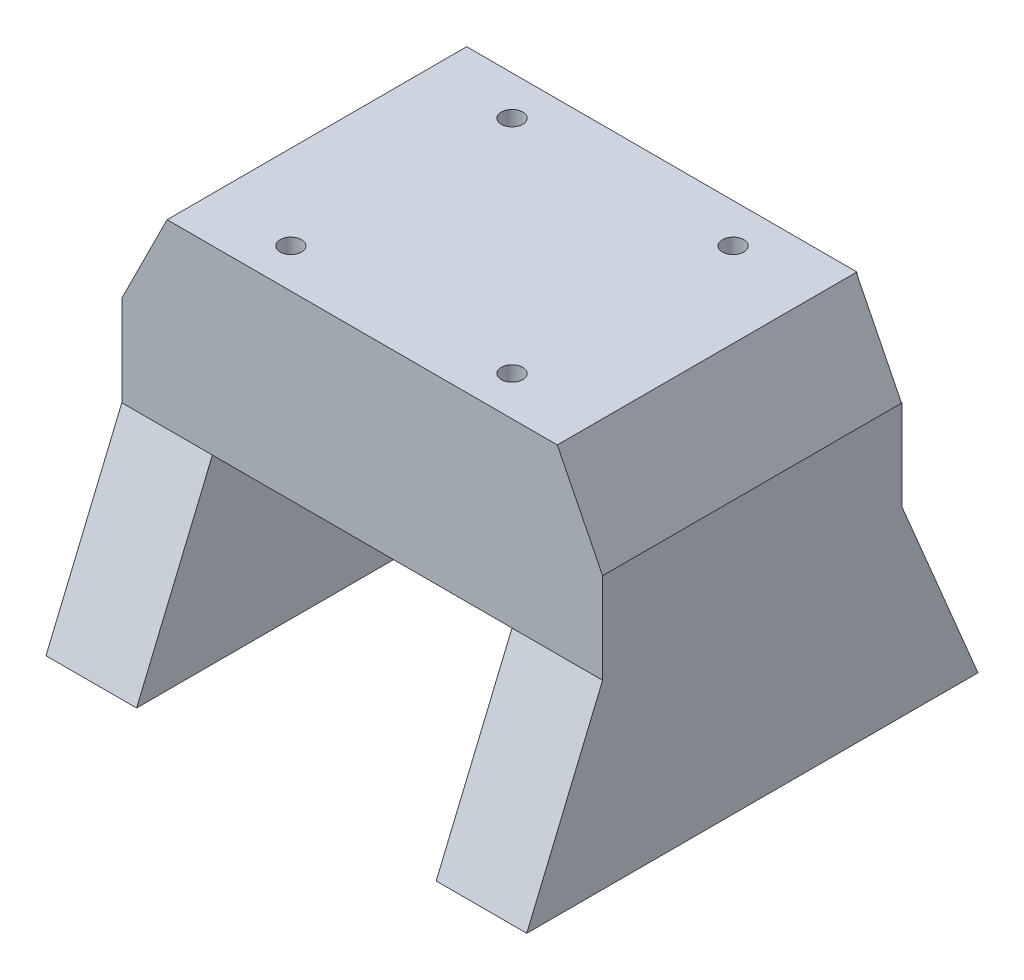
ISO-10303-21;
HEADER;
FILE_DESCRIPTION(('STEP AP214'),'2;1');
FILE_NAME('part.step','',(''),(''),'','','');
FILE_SCHEMA(('AUTOMOTIVE_DESIGN { 1 0 10303 214 1 1 1 1 }'));
ENDSEC;
DATA;
#1=APPLICATION_CONTEXT('core data for automotive mechanical design processes');
#2=APPLICATION_PROTOCOL_DEFINITION('international standard','automotive_design',2000,#1);
#3=PRODUCT_CONTEXT('',#1,'mechanical');
#4=PRODUCT('Part','Part','',(#3));
#5=PRODUCT_RELATED_PRODUCT_CATEGORY('part','',(#4));
#6=PRODUCT_DEFINITION_FORMATION('','',#4);
#7=PRODUCT_DEFINITION_CONTEXT('part definition',#1,'design');
#8=PRODUCT_DEFINITION('design','',#6,#7);
#9=PRODUCT_DEFINITION_SHAPE('','',#8);
#10=(LENGTH_UNIT() NAMED_UNIT(*) SI_UNIT(.MILLI.,.METRE.));
#11=(NAMED_UNIT(*) PLANE_ANGLE_UNIT() SI_UNIT($,.RADIAN.));
#12=(NAMED_UNIT(*) SI_UNIT($,.STERADIAN.) SOLID_ANGLE_UNIT());
#13=UNCERTAINTY_MEASURE_WITH_UNIT(LENGTH_MEASURE(1.E-05),#10,'distance_accuracy_value','');
#14=(GEOMETRIC_REPRESENTATION_CONTEXT(3) GLOBAL_UNCERTAINTY_ASSIGNED_CONTEXT((#13)) GLOBAL_UNIT_ASSIGNED_CONTEXT((#10,
#11,#12)) REPRESENTATION_CONTEXT('',''));
#15=CARTESIAN_POINT('',(0.,0.,0.));
#16=DIRECTION('',(0.,0.,1.));
#17=DIRECTION('',(1.,0.,0.));
#18=AXIS2_PLACEMENT_3D('',#15,#16,#17);
#19=CARTESIAN_POINT('',(27.350000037,25.4,-21.));
#20=DIRECTION('',(-1.,0.,0.));
#21=DIRECTION('',(0.,0.,1.));
#22=AXIS2_PLACEMENT_3D('',#19,#20,#21);
#23=PLANE('',#22);
#24=DIRECTION('',(0.,1.,0.));
#25=VECTOR('',#24,1.);
#26=CARTESIAN_POINT('',(27.350000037,0.,-20.91));
#27=LINE('',#26,#25);
#28=CARTESIAN_POINT('',(27.350000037,12.7,-20.91));
#29=VERTEX_POINT('',#28);
#30=CARTESIAN_POINT('',(27.350000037,25.4,-20.91));
#31=VERTEX_POINT('',#30);
#32=EDGE_CURVE('E67',#29,#31,#27,.T.);
#33=ORIENTED_EDGE('',*,*,#32,.F.);
#34=DIRECTION('',(0.,0.,-1.));
#35=VECTOR('',#34,1.);
#36=CARTESIAN_POINT('',(27.350000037,12.7,-21.));
#37=LINE('',#36,#35);
#38=CARTESIAN_POINT('',(27.350000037,12.7,-21.));
#39=VERTEX_POINT('',#38);
#40=EDGE_CURVE('E242',#29,#39,#37,.T.);
#41=ORIENTED_EDGE('',*,*,#40,.T.);
#42=DIRECTION('',(0.,-1.,0.));
#43=VECTOR('',#42,1.);
#44=CARTESIAN_POINT('',(27.350000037,25.4,-21.));
#45=LINE('',#44,#43);
#46=CARTESIAN_POINT('',(27.350000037,25.4,-21.));
#47=VERTEX_POINT('',#46);
#48=EDGE_CURVE('E11',#47,#39,#45,.T.);
#49=ORIENTED_EDGE('',*,*,#48,.F.);
#50=DIRECTION('',(0.,0.,-1.));
#51=VECTOR('',#50,1.);
#52=CARTESIAN_POINT('',(27.350000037,25.4,-21.));
#53=LINE('',#52,#51);
#54=EDGE_CURVE('E62',#31,#47,#53,.T.);
#55=ORIENTED_EDGE('',*,*,#54,.F.);
#56=EDGE_LOOP('',(#33,#41,#49,#55));
#57=FACE_BOUND('',#56,.T.);
#58=ADVANCED_FACE('F47',(#57),#23,.F.);
#59=CARTESIAN_POINT('',(-27.350000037,25.4,-21.));
#60=DIRECTION('',(1.,0.,0.));
#61=DIRECTION('',(0.,0.,-1.));
#62=AXIS2_PLACEMENT_3D('',#59,#60,#61);
#63=PLANE('',#62);
#64=DIRECTION('',(0.,-1.,0.));
#65=VECTOR('',#64,1.);
#66=CARTESIAN_POINT('',(-27.350000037,0.,-20.91));
#67=LINE('',#66,#65);
#68=CARTESIAN_POINT('',(-27.350000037,25.4,-20.91));
#69=VERTEX_POINT('',#68);
#70=CARTESIAN_POINT('',(-27.350000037,12.7,-20.91));
#71=VERTEX_POINT('',#70);
#72=EDGE_CURVE('E159',#69,#71,#67,.T.);
#73=ORIENTED_EDGE('',*,*,#72,.F.);
#74=DIRECTION('',(0.,0.,1.));
#75=VECTOR('',#74,1.);
#76=CARTESIAN_POINT('',(-27.350000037,25.4,-21.));
#77=LINE('',#76,#75);
#78=CARTESIAN_POINT('',(-27.350000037,25.4,-21.));
#79=VERTEX_POINT('',#78);
#80=EDGE_CURVE('E284',#79,#69,#77,.T.);
#81=ORIENTED_EDGE('',*,*,#80,.F.);
#82=DIRECTION('',(0.,-1.,0.));
#83=VECTOR('',#82,1.);
#84=CARTESIAN_POINT('',(-27.350000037,25.4,-21.));
#85=LINE('',#84,#83);
#86=CARTESIAN_POINT('',(-27.350000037,12.7,-21.));
#87=VERTEX_POINT('',#86);
#88=EDGE_CURVE('E55',#79,#87,#85,.T.);
#89=ORIENTED_EDGE('',*,*,#88,.T.);
#90=DIRECTION('',(0.,0.,1.));
#91=VECTOR('',#90,1.);
#92=CARTESIAN_POINT('',(-27.350000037,12.7,-21.));
#93=LINE('',#92,#91);
#94=EDGE_CURVE('E176',#87,#71,#93,.T.);
#95=ORIENTED_EDGE('',*,*,#94,.T.);
#96=EDGE_LOOP('',(#73,#81,#89,#95));
#97=FACE_BOUND('',#96,.T.);
#98=ADVANCED_FACE('F183',(#97),#63,.F.);
#99=CARTESIAN_POINT('',(33.700000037,12.7,0.));
#100=DIRECTION('',(0.,1.,0.));
#101=DIRECTION('',(0.,0.,1.));
#102=AXIS2_PLACEMENT_3D('',#99,#100,#101);
#103=PLANE('',#102);
#104=ORIENTED_EDGE('',*,*,#40,.F.);
#105=DIRECTION('',(-1.,0.,0.));
#106=VECTOR('',#105,1.);
#107=CARTESIAN_POINT('',(0.,12.7,-20.91));
#108=LINE('',#107,#106);
#109=CARTESIAN_POINT('',(33.700000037,12.7,-20.91));
#110=VERTEX_POINT('',#109);
#111=EDGE_CURVE('E311',#110,#29,#108,.T.);
#112=ORIENTED_EDGE('',*,*,#111,.F.);
#113=DIRECTION('',(0.,0.,-1.));
#114=VECTOR('',#113,1.);
#115=CARTESIAN_POINT('',(33.700000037,12.7,0.));
#116=LINE('',#115,#114);
#117=CARTESIAN_POINT('',(33.700000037,12.7,-21.));
#118=VERTEX_POINT('',#117);
#119=EDGE_CURVE('E203',#110,#118,#116,.T.);
#120=ORIENTED_EDGE('',*,*,#119,.T.);
#121=DIRECTION('',(-1.,0.,0.));
#122=VECTOR('',#121,1.);
#123=CARTESIAN_POINT('',(33.700000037,12.7,-21.));
#124=LINE('',#123,#122);
#125=EDGE_CURVE('E220',#118,#39,#124,.T.);
#126=ORIENTED_EDGE('',*,*,#125,.T.);
#127=EDGE_LOOP('',(#104,#112,#120,#126));
#128=FACE_BOUND('',#127,.T.);
#129=ADVANCED_FACE('F308',(#128),#103,.T.);
#130=CARTESIAN_POINT('',(-21.000000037,12.7,0.));
#131=DIRECTION('',(0.,1.,0.));
#132=DIRECTION('',(0.,0.,1.));
#133=AXIS2_PLACEMENT_3D('',#130,#131,#132);
#134=PLANE('',#133);
#135=DIRECTION('',(0.,0.,-1.));
#136=VECTOR('',#135,1.);
#137=CARTESIAN_POINT('',(-33.700000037,12.7,0.));
#138=LINE('',#137,#136);
#139=CARTESIAN_POINT('',(-33.700000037,12.7,-20.91));
#140=VERTEX_POINT('',#139);
#141=CARTESIAN_POINT('',(-33.700000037,12.7,-21.));
#142=VERTEX_POINT('',#141);
#143=EDGE_CURVE('E178',#140,#142,#138,.T.);
#144=ORIENTED_EDGE('',*,*,#143,.F.);
#145=DIRECTION('',(-1.,0.,0.));
#146=VECTOR('',#145,1.);
#147=CARTESIAN_POINT('',(0.,12.7,-20.91));
#148=LINE('',#147,#146);
#149=EDGE_CURVE('E162',#71,#140,#148,.T.);
#150=ORIENTED_EDGE('',*,*,#149,.F.);
#151=ORIENTED_EDGE('',*,*,#94,.F.);
#152=DIRECTION('',(-1.,0.,0.));
#153=VECTOR('',#152,1.);
#154=CARTESIAN_POINT('',(-21.000000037,12.7,-21.));
#155=LINE('',#154,#153);
#156=EDGE_CURVE('E376',#87,#142,#155,.T.);
#157=ORIENTED_EDGE('',*,*,#156,.T.);
#158=EDGE_LOOP('',(#144,#150,#151,#157));
#159=FACE_BOUND('',#158,.T.);
#160=ADVANCED_FACE('F174',(#159),#134,.T.);
#161=CARTESIAN_POINT('',(0.,0.,0.));
#162=DIRECTION('',(0.,1.,0.));
#163=DIRECTION('',(0.,0.,1.));
#164=AXIS2_PLACEMENT_3D('',#161,#162,#163);
#165=PLANE('',#164);
#166=CARTESIAN_POINT('',(-15.5,0.,15.5));
#167=DIRECTION('',(0.,1.,0.));
#168=DIRECTION('',(0.,0.,1.));
#169=AXIS2_PLACEMENT_3D('',#166,#167,#168);
#170=CIRCLE('',#169,1.5);
#171=CARTESIAN_POINT('',(-15.5,0.,17.));
#172=VERTEX_POINT('',#171);
#173=EDGE_CURVE('E245',#172,#172,#170,.T.);
#174=ORIENTED_EDGE('',*,*,#173,.T.);
#175=EDGE_LOOP('',(#174));
#176=FACE_BOUND('',#175,.T.);
#177=CARTESIAN_POINT('',(15.5,0.,15.5));
#178=DIRECTION('',(0.,1.,0.));
#179=DIRECTION('',(0.,0.,1.));
#180=AXIS2_PLACEMENT_3D('',#177,#178,#179);
#181=CIRCLE('',#180,1.5);
#182=CARTESIAN_POINT('',(15.5,0.,17.));
#183=VERTEX_POINT('',#182);
#184=EDGE_CURVE('E250',#183,#183,#181,.T.);
#185=ORIENTED_EDGE('',*,*,#184,.T.);
#186=EDGE_LOOP('',(#185));
#187=FACE_BOUND('',#186,.T.);
#188=CARTESIAN_POINT('',(15.5,0.,-15.5));
#189=DIRECTION('',(0.,1.,0.));
#190=DIRECTION('',(0.,0.,1.));
#191=AXIS2_PLACEMENT_3D('',#188,#189,#190);
#192=CIRCLE('',#191,1.5);
#193=CARTESIAN_POINT('',(15.5,0.,-14.));
#194=VERTEX_POINT('',#193);
#195=EDGE_CURVE('E258',#194,#194,#192,.T.);
#196=ORIENTED_EDGE('',*,*,#195,.T.);
#197=EDGE_LOOP('',(#196));
#198=FACE_BOUND('',#197,.T.);
#199=CARTESIAN_POINT('',(-15.5,0.,-15.5));
#200=DIRECTION('',(0.,1.,0.));
#201=DIRECTION('',(0.,0.,1.));
#202=AXIS2_PLACEMENT_3D('',#199,#200,#201);
#203=CIRCLE('',#202,1.5);
#204=CARTESIAN_POINT('',(-15.5,0.,-14.));
#205=VERTEX_POINT('',#204);
#206=EDGE_CURVE('E266',#205,#205,#203,.T.);
#207=ORIENTED_EDGE('',*,*,#206,.T.);
#208=EDGE_LOOP('',(#207));
#209=FACE_BOUND('',#208,.T.);
#210=DIRECTION('',(1.,0.,0.));
#211=VECTOR('',#210,1.);
#212=CARTESIAN_POINT('',(-27.350000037,0.,21.));
#213=LINE('',#212,#211);
#214=CARTESIAN_POINT('',(-21.000000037,0.,21.));
#215=VERTEX_POINT('',#214);
#216=CARTESIAN_POINT('',(21.000000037,0.,21.));
#217=VERTEX_POINT('',#216);
#218=EDGE_CURVE('E298',#215,#217,#213,.T.);
#219=ORIENTED_EDGE('',*,*,#218,.F.);
#220=DIRECTION('',(0.,0.,-1.));
#221=VECTOR('',#220,1.);
#222=CARTESIAN_POINT('',(-21.000000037,0.,0.));
#223=LINE('',#222,#221);
#224=CARTESIAN_POINT('',(-21.000000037,0.,-21.));
#225=VERTEX_POINT('',#224);
#226=EDGE_CURVE('E187',#215,#225,#223,.T.);
#227=ORIENTED_EDGE('',*,*,#226,.T.);
#228=DIRECTION('',(-1.,0.,0.));
#229=VECTOR('',#228,1.);
#230=CARTESIAN_POINT('',(-27.350000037,0.,-21.));
#231=LINE('',#230,#229);
#232=CARTESIAN_POINT('',(21.000000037,0.,-21.));
#233=VERTEX_POINT('',#232);
#234=EDGE_CURVE('E274',#233,#225,#231,.T.);
#235=ORIENTED_EDGE('',*,*,#234,.F.);
#236=DIRECTION('',(0.,0.,-1.));
#237=VECTOR('',#236,1.);
#238=CARTESIAN_POINT('',(21.000000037,0.,0.));
#239=LINE('',#238,#237);
#240=EDGE_CURVE('E239',#217,#233,#239,.T.);
#241=ORIENTED_EDGE('',*,*,#240,.F.);
#242=EDGE_LOOP('',(#219,#227,#235,#241));
#243=FACE_BOUND('',#242,.T.);
#244=ADVANCED_FACE('F402',(#176,#187,#198,#209,#243),#165,.F.);
#245=CARTESIAN_POINT('',(0.,25.4,0.));
#246=DIRECTION('',(0.,1.,0.));
#247=DIRECTION('',(0.,0.,1.));
#248=AXIS2_PLACEMENT_3D('',#245,#246,#247);
#249=PLANE('',#248);
#250=CARTESIAN_POINT('',(15.5,25.4,15.5));
#251=DIRECTION('',(0.,1.,0.));
#252=DIRECTION('',(0.,0.,1.));
#253=AXIS2_PLACEMENT_3D('',#250,#251,#252);
#254=CIRCLE('',#253,1.5);
#255=CARTESIAN_POINT('',(15.5,25.4,17.));
#256=VERTEX_POINT('',#255);
#257=EDGE_CURVE('E254',#256,#256,#254,.T.);
#258=ORIENTED_EDGE('',*,*,#257,.F.);
#259=EDGE_LOOP('',(#258));
#260=FACE_BOUND('',#259,.T.);
#261=CARTESIAN_POINT('',(-15.5,25.4,-15.5));
#262=DIRECTION('',(0.,1.,0.));
#263=DIRECTION('',(0.,0.,1.));
#264=AXIS2_PLACEMENT_3D('',#261,#262,#263);
#265=CIRCLE('',#264,1.5);
#266=CARTESIAN_POINT('',(-15.5,25.4,-14.));
#267=VERTEX_POINT('',#266);
#268=EDGE_CURVE('E270',#267,#267,#265,.T.);
#269=ORIENTED_EDGE('',*,*,#268,.F.);
#270=EDGE_LOOP('',(#269));
#271=FACE_BOUND('',#270,.T.);
#272=CARTESIAN_POINT('',(27.350000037,25.4,21.));
#273=VERTEX_POINT('',#272);
#274=EDGE_CURVE('E278',#273,#31,#53,.T.);
#275=ORIENTED_EDGE('',*,*,#274,.T.);
#276=ORIENTED_EDGE('',*,*,#54,.T.);
#277=DIRECTION('',(-1.,0.,0.));
#278=VECTOR('',#277,1.);
#279=CARTESIAN_POINT('',(-27.350000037,25.4,-21.));
#280=LINE('',#279,#278);
#281=EDGE_CURVE('E281',#47,#79,#280,.T.);
#282=ORIENTED_EDGE('',*,*,#281,.T.);
#283=ORIENTED_EDGE('',*,*,#80,.T.);
#284=DIRECTION('',(0.,0.,1.));
#285=VECTOR('',#284,1.);
#286=CARTESIAN_POINT('',(-27.350000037,25.4,-20.91));
#287=LINE('',#286,#285);
#288=CARTESIAN_POINT('',(-27.350000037,25.4,21.));
#289=VERTEX_POINT('',#288);
#290=EDGE_CURVE('E171',#69,#289,#287,.T.);
#291=ORIENTED_EDGE('',*,*,#290,.T.);
#292=DIRECTION('',(1.,0.,0.));
#293=VECTOR('',#292,1.);
#294=CARTESIAN_POINT('',(-27.350000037,25.4,21.));
#295=LINE('',#294,#293);
#296=EDGE_CURVE('E287',#289,#273,#295,.T.);
#297=ORIENTED_EDGE('',*,*,#296,.T.);
#298=EDGE_LOOP('',(#275,#276,#282,#283,#291,#297));
#299=FACE_BOUND('',#298,.T.);
#300=CARTESIAN_POINT('',(15.5,25.4,-15.5));
#301=DIRECTION('',(0.,1.,0.));
#302=DIRECTION('',(0.,0.,1.));
#303=AXIS2_PLACEMENT_3D('',#300,#301,#302);
#304=CIRCLE('',#303,1.5);
#305=CARTESIAN_POINT('',(15.5,25.4,-14.));
#306=VERTEX_POINT('',#305);
#307=EDGE_CURVE('E262',#306,#306,#304,.T.);
#308=ORIENTED_EDGE('',*,*,#307,.F.);
#309=EDGE_LOOP('',(#308));
#310=FACE_BOUND('',#309,.T.);
#311=CARTESIAN_POINT('',(-15.5,25.4,15.5));
#312=DIRECTION('',(0.,1.,0.));
#313=DIRECTION('',(0.,0.,1.));
#314=AXIS2_PLACEMENT_3D('',#311,#312,#313);
#315=CIRCLE('',#314,1.5);
#316=CARTESIAN_POINT('',(-15.5,25.4,17.));
#317=VERTEX_POINT('',#316);
#318=EDGE_CURVE('E246',#317,#317,#315,.T.);
#319=ORIENTED_EDGE('',*,*,#318,.F.);
#320=EDGE_LOOP('',(#319));
#321=FACE_BOUND('',#320,.T.);
#322=ADVANCED_FACE('F433',(#260,#271,#299,#310,#321),#249,.T.);
#323=CARTESIAN_POINT('',(-27.350000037,25.4,-21.));
#324=DIRECTION('',(0.,0.,1.));
#325=DIRECTION('',(1.,0.,0.));
#326=AXIS2_PLACEMENT_3D('',#323,#324,#325);
#327=PLANE('',#326);
#328=ORIENTED_EDGE('',*,*,#156,.F.);
#329=ORIENTED_EDGE('',*,*,#88,.F.);
#330=ORIENTED_EDGE('',*,*,#281,.F.);
#331=ORIENTED_EDGE('',*,*,#48,.T.);
#332=ORIENTED_EDGE('',*,*,#125,.F.);
#333=DIRECTION('',(0.,1.,0.));
#334=VECTOR('',#333,1.);
#335=CARTESIAN_POINT('',(33.700000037,0.,-21.));
#336=LINE('',#335,#334);
#337=CARTESIAN_POINT('',(33.700000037,0.,-21.));
#338=VERTEX_POINT('',#337);
#339=EDGE_CURVE('E217',#338,#118,#336,.T.);
#340=ORIENTED_EDGE('',*,*,#339,.F.);
#341=EDGE_CURVE('E290',#338,#233,#231,.T.);
#342=ORIENTED_EDGE('',*,*,#341,.T.);
#343=ORIENTED_EDGE('',*,*,#234,.T.);
#344=DIRECTION('',(-1.,0.,0.));
#345=VECTOR('',#344,1.);
#346=CARTESIAN_POINT('',(-21.000000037,0.,-21.));
#347=LINE('',#346,#345);
#348=CARTESIAN_POINT('',(-33.700000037,0.,-21.));
#349=VERTEX_POINT('',#348);
#350=EDGE_CURVE('E379',#225,#349,#347,.T.);
#351=ORIENTED_EDGE('',*,*,#350,.T.);
#352=DIRECTION('',(0.,1.,0.));
#353=VECTOR('',#352,1.);
#354=CARTESIAN_POINT('',(-33.700000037,0.,-21.));
#355=LINE('',#354,#353);
#356=EDGE_CURVE('E360',#349,#142,#355,.T.);
#357=ORIENTED_EDGE('',*,*,#356,.T.);
#358=EDGE_LOOP('',(#328,#329,#330,#331,#332,#340,#342,#343,#351,#357));
#359=FACE_BOUND('',#358,.T.);
#360=ADVANCED_FACE('F318',(#359),#327,.F.);
#361=CARTESIAN_POINT('',(-27.350000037,25.4,21.));
#362=DIRECTION('',(0.,0.,-1.));
#363=DIRECTION('',(-1.,0.,0.));
#364=AXIS2_PLACEMENT_3D('',#361,#362,#363);
#365=PLANE('',#364);
#366=ORIENTED_EDGE('',*,*,#296,.F.);
#367=DIRECTION('',(0.447213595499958,0.894427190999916,0.));
#368=VECTOR('',#367,1.);
#369=CARTESIAN_POINT('',(-32.0400000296,16.0200000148,21.));
#370=LINE('',#369,#368);
#371=CARTESIAN_POINT('',(-33.700000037,12.7,21.));
#372=VERTEX_POINT('',#371);
#373=EDGE_CURVE('E337',#372,#289,#370,.T.);
#374=ORIENTED_EDGE('',*,*,#373,.F.);
#375=DIRECTION('',(0.,-1.,0.));
#376=VECTOR('',#375,1.);
#377=CARTESIAN_POINT('',(-33.700000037,0.,21.));
#378=LINE('',#377,#376);
#379=CARTESIAN_POINT('',(-33.700000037,0.,21.));
#380=VERTEX_POINT('',#379);
#381=EDGE_CURVE('E367',#372,#380,#378,.T.);
#382=ORIENTED_EDGE('',*,*,#381,.T.);
#383=EDGE_CURVE('E295',#380,#215,#213,.T.);
#384=ORIENTED_EDGE('',*,*,#383,.T.);
#385=ORIENTED_EDGE('',*,*,#218,.T.);
#386=CARTESIAN_POINT('',(33.700000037,0.,21.));
#387=VERTEX_POINT('',#386);
#388=EDGE_CURVE('E294',#217,#387,#213,.T.);
#389=ORIENTED_EDGE('',*,*,#388,.T.);
#390=DIRECTION('',(0.,-1.,0.));
#391=VECTOR('',#390,1.);
#392=CARTESIAN_POINT('',(33.700000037,0.,21.));
#393=LINE('',#392,#391);
#394=CARTESIAN_POINT('',(33.700000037,12.7,21.));
#395=VERTEX_POINT('',#394);
#396=EDGE_CURVE('E202',#395,#387,#393,.T.);
#397=ORIENTED_EDGE('',*,*,#396,.F.);
#398=DIRECTION('',(-0.447213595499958,0.894427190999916,0.));
#399=VECTOR('',#398,1.);
#400=CARTESIAN_POINT('',(32.0400000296,16.0200000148,21.));
#401=LINE('',#400,#399);
#402=EDGE_CURVE('E326',#395,#273,#401,.T.);
#403=ORIENTED_EDGE('',*,*,#402,.T.);
#404=EDGE_LOOP('',(#366,#374,#382,#384,#385,#389,#397,#403));
#405=FACE_BOUND('',#404,.T.);
#406=ADVANCED_FACE('F407',(#405),#365,.F.);
#407=CARTESIAN_POINT('',(-15.5,25.4,-15.5));
#408=DIRECTION('',(0.,-1.,0.));
#409=DIRECTION('',(0.,0.,-1.));
#410=AXIS2_PLACEMENT_3D('',#407,#408,#409);
#411=CYLINDRICAL_SURFACE('',#410,1.5);
#412=ORIENTED_EDGE('',*,*,#268,.T.);
#413=EDGE_LOOP('',(#412));
#414=FACE_BOUND('',#413,.T.);
#415=ORIENTED_EDGE('',*,*,#206,.F.);
#416=EDGE_LOOP('',(#415));
#417=FACE_BOUND('',#416,.T.);
#418=ADVANCED_FACE('F439',(#414,#417),#411,.F.);
#419=CARTESIAN_POINT('',(15.5,25.4,-15.5));
#420=DIRECTION('',(0.,-1.,0.));
#421=DIRECTION('',(0.,0.,-1.));
#422=AXIS2_PLACEMENT_3D('',#419,#420,#421);
#423=CYLINDRICAL_SURFACE('',#422,1.5);
#424=ORIENTED_EDGE('',*,*,#307,.T.);
#425=EDGE_LOOP('',(#424));
#426=FACE_BOUND('',#425,.T.);
#427=ORIENTED_EDGE('',*,*,#195,.F.);
#428=EDGE_LOOP('',(#427));
#429=FACE_BOUND('',#428,.T.);
#430=ADVANCED_FACE('F452',(#426,#429),#423,.F.);
#431=CARTESIAN_POINT('',(15.5,25.4,15.5));
#432=DIRECTION('',(0.,-1.,0.));
#433=DIRECTION('',(0.,0.,-1.));
#434=AXIS2_PLACEMENT_3D('',#431,#432,#433);
#435=CYLINDRICAL_SURFACE('',#434,1.5);
#436=ORIENTED_EDGE('',*,*,#257,.T.);
#437=EDGE_LOOP('',(#436));
#438=FACE_BOUND('',#437,.T.);
#439=ORIENTED_EDGE('',*,*,#184,.F.);
#440=EDGE_LOOP('',(#439));
#441=FACE_BOUND('',#440,.T.);
#442=ADVANCED_FACE('F456',(#438,#441),#435,.F.);
#443=CARTESIAN_POINT('',(-15.5,25.4,15.5));
#444=DIRECTION('',(0.,-1.,0.));
#445=DIRECTION('',(0.,0.,-1.));
#446=AXIS2_PLACEMENT_3D('',#443,#444,#445);
#447=CYLINDRICAL_SURFACE('',#446,1.5);
#448=ORIENTED_EDGE('',*,*,#318,.T.);
#449=EDGE_LOOP('',(#448));
#450=FACE_BOUND('',#449,.T.);
#451=ORIENTED_EDGE('',*,*,#173,.F.);
#452=EDGE_LOOP('',(#451));
#453=FACE_BOUND('',#452,.T.);
#454=ADVANCED_FACE('F460',(#450,#453),#447,.F.);
#455=CARTESIAN_POINT('',(21.000000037,0.,0.));
#456=DIRECTION('',(1.,0.,0.));
#457=DIRECTION('',(0.,0.,-1.));
#458=AXIS2_PLACEMENT_3D('',#455,#456,#457);
#459=PLANE('',#458);
#460=DIRECTION('',(0.,-0.922496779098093,0.386004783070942));
#461=VECTOR('',#460,1.);
#462=CARTESIAN_POINT('',(21.000000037,7.47785155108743,17.8710064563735));
#463=LINE('',#462,#461);
#464=CARTESIAN_POINT('',(21.000000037,-25.4,31.6282446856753));
#465=VERTEX_POINT('',#464);
#466=EDGE_CURVE('E186',#217,#465,#463,.T.);
#467=ORIENTED_EDGE('',*,*,#466,.F.);
#468=ORIENTED_EDGE('',*,*,#240,.T.);
#469=DIRECTION('',(0.,0.922496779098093,0.386004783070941));
#470=VECTOR('',#469,1.);
#471=CARTESIAN_POINT('',(21.000000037,7.47785155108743,-17.8710064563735));
#472=LINE('',#471,#470);
#473=CARTESIAN_POINT('',(21.000000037,-25.4,-31.6282446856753));
#474=VERTEX_POINT('',#473);
#475=EDGE_CURVE('E224',#474,#233,#472,.T.);
#476=ORIENTED_EDGE('',*,*,#475,.F.);
#477=DIRECTION('',(0.,0.,-1.));
#478=VECTOR('',#477,1.);
#479=CARTESIAN_POINT('',(21.000000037,-25.4,0.));
#480=LINE('',#479,#478);
#481=EDGE_CURVE('E191',#465,#474,#480,.T.);
#482=ORIENTED_EDGE('',*,*,#481,.F.);
#483=EDGE_LOOP('',(#467,#468,#476,#482));
#484=FACE_BOUND('',#483,.T.);
#485=ADVANCED_FACE('F463',(#484),#459,.F.);
#486=CARTESIAN_POINT('',(33.700000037,7.47785155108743,17.8710064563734));
#487=DIRECTION('',(0.,-0.386004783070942,-0.922496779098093));
#488=DIRECTION('',(0.,0.922496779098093,-0.386004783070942));
#489=AXIS2_PLACEMENT_3D('',#486,#487,#488);
#490=PLANE('',#489);
#491=ORIENTED_EDGE('',*,*,#466,.T.);
#492=DIRECTION('',(-1.,0.,0.));
#493=VECTOR('',#492,1.);
#494=CARTESIAN_POINT('',(33.700000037,-25.4,31.6282446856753));
#495=LINE('',#494,#493);
#496=CARTESIAN_POINT('',(33.700000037,-25.4,31.6282446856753));
#497=VERTEX_POINT('',#496);
#498=EDGE_CURVE('E235',#497,#465,#495,.T.);
#499=ORIENTED_EDGE('',*,*,#498,.F.);
#500=DIRECTION('',(0.,-0.922496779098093,0.386004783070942));
#501=VECTOR('',#500,1.);
#502=CARTESIAN_POINT('',(33.700000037,7.47785155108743,17.8710064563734));
#503=LINE('',#502,#501);
#504=EDGE_CURVE('E207',#387,#497,#503,.T.);
#505=ORIENTED_EDGE('',*,*,#504,.F.);
#506=ORIENTED_EDGE('',*,*,#388,.F.);
#507=EDGE_LOOP('',(#491,#499,#505,#506));
#508=FACE_BOUND('',#507,.T.);
#509=ADVANCED_FACE('F466',(#508),#490,.F.);
#510=CARTESIAN_POINT('',(33.700000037,-25.4,0.));
#511=DIRECTION('',(0.,1.,0.));
#512=DIRECTION('',(0.,0.,1.));
#513=AXIS2_PLACEMENT_3D('',#510,#511,#512);
#514=PLANE('',#513);
#515=ORIENTED_EDGE('',*,*,#481,.T.);
#516=DIRECTION('',(-1.,0.,0.));
#517=VECTOR('',#516,1.);
#518=CARTESIAN_POINT('',(33.700000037,-25.4,-31.6282446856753));
#519=LINE('',#518,#517);
#520=CARTESIAN_POINT('',(33.700000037,-25.4,-31.6282446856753));
#521=VERTEX_POINT('',#520);
#522=EDGE_CURVE('E231',#521,#474,#519,.T.);
#523=ORIENTED_EDGE('',*,*,#522,.F.);
#524=DIRECTION('',(0.,0.,-1.));
#525=VECTOR('',#524,1.);
#526=CARTESIAN_POINT('',(33.700000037,-25.4,0.));
#527=LINE('',#526,#525);
#528=EDGE_CURVE('E210',#497,#521,#527,.T.);
#529=ORIENTED_EDGE('',*,*,#528,.F.);
#530=ORIENTED_EDGE('',*,*,#498,.T.);
#531=EDGE_LOOP('',(#515,#523,#529,#530));
#532=FACE_BOUND('',#531,.T.);
#533=ADVANCED_FACE('F469',(#532),#514,.F.);
#534=CARTESIAN_POINT('',(33.700000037,7.47785155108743,-17.8710064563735));
#535=DIRECTION('',(0.,-0.386004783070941,0.922496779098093));
#536=DIRECTION('',(0.,-0.922496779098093,-0.386004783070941));
#537=AXIS2_PLACEMENT_3D('',#534,#535,#536);
#538=PLANE('',#537);
#539=ORIENTED_EDGE('',*,*,#475,.T.);
#540=ORIENTED_EDGE('',*,*,#341,.F.);
#541=DIRECTION('',(0.,0.922496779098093,0.386004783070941));
#542=VECTOR('',#541,1.);
#543=CARTESIAN_POINT('',(33.700000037,7.47785155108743,-17.8710064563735));
#544=LINE('',#543,#542);
#545=EDGE_CURVE('E213',#521,#338,#544,.T.);
#546=ORIENTED_EDGE('',*,*,#545,.F.);
#547=ORIENTED_EDGE('',*,*,#522,.T.);
#548=EDGE_LOOP('',(#539,#540,#546,#547));
#549=FACE_BOUND('',#548,.T.);
#550=ADVANCED_FACE('F473',(#549),#538,.F.);
#551=CARTESIAN_POINT('',(33.700000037,0.,0.));
#552=DIRECTION('',(1.,0.,0.));
#553=DIRECTION('',(0.,0.,-1.));
#554=AXIS2_PLACEMENT_3D('',#551,#552,#553);
#555=PLANE('',#554);
#556=EDGE_CURVE('E198',#395,#110,#116,.T.);
#557=ORIENTED_EDGE('',*,*,#556,.F.);
#558=ORIENTED_EDGE('',*,*,#396,.T.);
#559=ORIENTED_EDGE('',*,*,#504,.T.);
#560=ORIENTED_EDGE('',*,*,#528,.T.);
#561=ORIENTED_EDGE('',*,*,#545,.T.);
#562=ORIENTED_EDGE('',*,*,#339,.T.);
#563=ORIENTED_EDGE('',*,*,#119,.F.);
#564=EDGE_LOOP('',(#557,#558,#559,#560,#561,#562,#563));
#565=FACE_BOUND('',#564,.T.);
#566=ADVANCED_FACE('F315',(#565),#555,.T.);
#567=CARTESIAN_POINT('',(-21.000000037,0.,0.));
#568=DIRECTION('',(1.,0.,0.));
#569=DIRECTION('',(0.,0.,-1.));
#570=AXIS2_PLACEMENT_3D('',#567,#568,#569);
#571=PLANE('',#570);
#572=ORIENTED_EDGE('',*,*,#226,.F.);
#573=DIRECTION('',(0.,-0.922496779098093,0.386004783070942));
#574=VECTOR('',#573,1.);
#575=CARTESIAN_POINT('',(-21.000000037,7.47785155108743,17.8710064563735));
#576=LINE('',#575,#574);
#577=CARTESIAN_POINT('',(-21.000000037,-25.4,31.6282446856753));
#578=VERTEX_POINT('',#577);
#579=EDGE_CURVE('E348',#215,#578,#576,.T.);
#580=ORIENTED_EDGE('',*,*,#579,.T.);
#581=DIRECTION('',(0.,0.,-1.));
#582=VECTOR('',#581,1.);
#583=CARTESIAN_POINT('',(-21.000000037,-25.4,0.));
#584=LINE('',#583,#582);
#585=CARTESIAN_POINT('',(-21.000000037,-25.4,-31.6282446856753));
#586=VERTEX_POINT('',#585);
#587=EDGE_CURVE('E339',#578,#586,#584,.T.);
#588=ORIENTED_EDGE('',*,*,#587,.T.);
#589=DIRECTION('',(0.,0.922496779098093,0.386004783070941));
#590=VECTOR('',#589,1.);
#591=CARTESIAN_POINT('',(-21.000000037,7.47785155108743,-17.8710064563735));
#592=LINE('',#591,#590);
#593=EDGE_CURVE('E343',#586,#225,#592,.T.);
#594=ORIENTED_EDGE('',*,*,#593,.T.);
#595=EDGE_LOOP('',(#572,#580,#588,#594));
#596=FACE_BOUND('',#595,.T.);
#597=ADVANCED_FACE('F399',(#596),#571,.T.);
#598=CARTESIAN_POINT('',(-21.000000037,-25.4,0.));
#599=DIRECTION('',(0.,1.,0.));
#600=DIRECTION('',(0.,0.,1.));
#601=AXIS2_PLACEMENT_3D('',#598,#599,#600);
#602=PLANE('',#601);
#603=DIRECTION('',(0.,0.,-1.));
#604=VECTOR('',#603,1.);
#605=CARTESIAN_POINT('',(-33.700000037,-25.4,0.));
#606=LINE('',#605,#604);
#607=CARTESIAN_POINT('',(-33.700000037,-25.4,31.6282446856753));
#608=VERTEX_POINT('',#607);
#609=CARTESIAN_POINT('',(-33.700000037,-25.4,-31.6282446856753));
#610=VERTEX_POINT('',#609);
#611=EDGE_CURVE('E352',#608,#610,#606,.T.);
#612=ORIENTED_EDGE('',*,*,#611,.T.);
#613=DIRECTION('',(-1.,0.,0.));
#614=VECTOR('',#613,1.);
#615=CARTESIAN_POINT('',(-21.000000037,-25.4,-31.6282446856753));
#616=LINE('',#615,#614);
#617=EDGE_CURVE('E194',#586,#610,#616,.T.);
#618=ORIENTED_EDGE('',*,*,#617,.F.);
#619=ORIENTED_EDGE('',*,*,#587,.F.);
#620=DIRECTION('',(-1.,0.,0.));
#621=VECTOR('',#620,1.);
#622=CARTESIAN_POINT('',(-21.000000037,-25.4,31.6282446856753));
#623=LINE('',#622,#621);
#624=EDGE_CURVE('E351',#578,#608,#623,.T.);
#625=ORIENTED_EDGE('',*,*,#624,.T.);
#626=EDGE_LOOP('',(#612,#618,#619,#625));
#627=FACE_BOUND('',#626,.T.);
#628=ADVANCED_FACE('F390',(#627),#602,.F.);
#629=CARTESIAN_POINT('',(-21.000000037,7.47785155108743,-17.8710064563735));
#630=DIRECTION('',(0.,-0.386004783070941,0.922496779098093));
#631=DIRECTION('',(0.,-0.922496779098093,-0.386004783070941));
#632=AXIS2_PLACEMENT_3D('',#629,#630,#631);
#633=PLANE('',#632);
#634=DIRECTION('',(0.,0.922496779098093,0.386004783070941));
#635=VECTOR('',#634,1.);
#636=CARTESIAN_POINT('',(-33.700000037,7.47785155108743,-17.8710064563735));
#637=LINE('',#636,#635);
#638=EDGE_CURVE('E356',#610,#349,#637,.T.);
#639=ORIENTED_EDGE('',*,*,#638,.T.);
#640=ORIENTED_EDGE('',*,*,#350,.F.);
#641=ORIENTED_EDGE('',*,*,#593,.F.);
#642=ORIENTED_EDGE('',*,*,#617,.T.);
#643=EDGE_LOOP('',(#639,#640,#641,#642));
#644=FACE_BOUND('',#643,.T.);
#645=ADVANCED_FACE('F385',(#644),#633,.F.);
#646=CARTESIAN_POINT('',(-21.000000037,7.47785155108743,17.8710064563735));
#647=DIRECTION('',(0.,-0.386004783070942,-0.922496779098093));
#648=DIRECTION('',(0.,0.922496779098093,-0.386004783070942));
#649=AXIS2_PLACEMENT_3D('',#646,#647,#648);
#650=PLANE('',#649);
#651=DIRECTION('',(0.,-0.922496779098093,0.386004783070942));
#652=VECTOR('',#651,1.);
#653=CARTESIAN_POINT('',(-33.700000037,7.47785155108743,17.8710064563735));
#654=LINE('',#653,#652);
#655=EDGE_CURVE('E344',#380,#608,#654,.T.);
#656=ORIENTED_EDGE('',*,*,#655,.T.);
#657=ORIENTED_EDGE('',*,*,#624,.F.);
#658=ORIENTED_EDGE('',*,*,#579,.F.);
#659=ORIENTED_EDGE('',*,*,#383,.F.);
#660=EDGE_LOOP('',(#656,#657,#658,#659));
#661=FACE_BOUND('',#660,.T.);
#662=ADVANCED_FACE('F410',(#661),#650,.F.);
#663=CARTESIAN_POINT('',(-33.700000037,0.,0.));
#664=DIRECTION('',(1.,0.,0.));
#665=DIRECTION('',(0.,0.,-1.));
#666=AXIS2_PLACEMENT_3D('',#663,#664,#665);
#667=PLANE('',#666);
#668=ORIENTED_EDGE('',*,*,#611,.F.);
#669=ORIENTED_EDGE('',*,*,#655,.F.);
#670=ORIENTED_EDGE('',*,*,#381,.F.);
#671=EDGE_CURVE('E364',#372,#140,#138,.T.);
#672=ORIENTED_EDGE('',*,*,#671,.T.);
#673=ORIENTED_EDGE('',*,*,#143,.T.);
#674=ORIENTED_EDGE('',*,*,#356,.F.);
#675=ORIENTED_EDGE('',*,*,#638,.F.);
#676=EDGE_LOOP('',(#668,#669,#670,#672,#673,#674,#675));
#677=FACE_BOUND('',#676,.T.);
#678=ADVANCED_FACE('F394',(#677),#667,.F.);
#679=CARTESIAN_POINT('',(-32.0400000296,16.0200000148,-20.91));
#680=DIRECTION('',(0.894427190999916,-0.447213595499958,0.));
#681=DIRECTION('',(0.447213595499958,0.894427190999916,0.));
#682=AXIS2_PLACEMENT_3D('',#679,#680,#681);
#683=PLANE('',#682);
#684=ORIENTED_EDGE('',*,*,#373,.T.);
#685=ORIENTED_EDGE('',*,*,#290,.F.);
#686=DIRECTION('',(0.447213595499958,0.894427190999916,0.));
#687=VECTOR('',#686,1.);
#688=CARTESIAN_POINT('',(-32.0400000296,16.0200000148,-20.91));
#689=LINE('',#688,#687);
#690=EDGE_CURVE('E164',#140,#69,#689,.T.);
#691=ORIENTED_EDGE('',*,*,#690,.F.);
#692=ORIENTED_EDGE('',*,*,#671,.F.);
#693=EDGE_LOOP('',(#684,#685,#691,#692));
#694=FACE_BOUND('',#693,.T.);
#695=ADVANCED_FACE('F418',(#694),#683,.F.);
#696=CARTESIAN_POINT('',(0.,0.,-20.91));
#697=DIRECTION('',(0.,0.,1.));
#698=DIRECTION('',(1.,0.,0.));
#699=AXIS2_PLACEMENT_3D('',#696,#697,#698);
#700=PLANE('',#699);
#701=ORIENTED_EDGE('',*,*,#690,.T.);
#702=ORIENTED_EDGE('',*,*,#72,.T.);
#703=ORIENTED_EDGE('',*,*,#149,.T.);
#704=EDGE_LOOP('',(#701,#702,#703));
#705=FACE_BOUND('',#704,.T.);
#706=ADVANCED_FACE('F161',(#705),#700,.F.);
#707=CARTESIAN_POINT('',(32.0400000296,16.0200000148,-20.91));
#708=DIRECTION('',(0.894427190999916,0.447213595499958,0.));
#709=DIRECTION('',(-0.447213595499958,0.894427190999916,0.));
#710=AXIS2_PLACEMENT_3D('',#707,#708,#709);
#711=PLANE('',#710);
#712=ORIENTED_EDGE('',*,*,#402,.F.);
#713=ORIENTED_EDGE('',*,*,#556,.T.);
#714=DIRECTION('',(-0.447213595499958,0.894427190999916,0.));
#715=VECTOR('',#714,1.);
#716=CARTESIAN_POINT('',(32.0400000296,16.0200000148,-20.91));
#717=LINE('',#716,#715);
#718=EDGE_CURVE('E324',#110,#31,#717,.T.);
#719=ORIENTED_EDGE('',*,*,#718,.T.);
#720=ORIENTED_EDGE('',*,*,#274,.F.);
#721=EDGE_LOOP('',(#712,#713,#719,#720));
#722=FACE_BOUND('',#721,.T.);
#723=ADVANCED_FACE('F518',(#722),#711,.T.);
#724=CARTESIAN_POINT('',(0.,0.,-20.91));
#725=DIRECTION('',(0.,0.,1.));
#726=DIRECTION('',(1.,0.,0.));
#727=AXIS2_PLACEMENT_3D('',#724,#725,#726);
#728=PLANE('',#727);
#729=ORIENTED_EDGE('',*,*,#111,.T.);
#730=ORIENTED_EDGE('',*,*,#32,.T.);
#731=ORIENTED_EDGE('',*,*,#718,.F.);
#732=EDGE_LOOP('',(#729,#730,#731));
#733=FACE_BOUND('',#732,.T.);
#734=ADVANCED_FACE('F322',(#733),#728,.F.);
#735=CLOSED_SHELL('',(#58,#98,#129,#160,#244,#322,#360,#406,#418,#430,#442,#454,#485,#509,#533,
#550,#566,#597,#628,#645,#662,#678,#695,#706,#723,#734));
#736=MANIFOLD_SOLID_BREP('B2',#735);
#737=ADVANCED_BREP_SHAPE_REPRESENTATION('',(#18,#736),#14);
#738=SHAPE_DEFINITION_REPRESENTATION(#9,#737);
ENDSEC;
END-ISO-10303-21;
